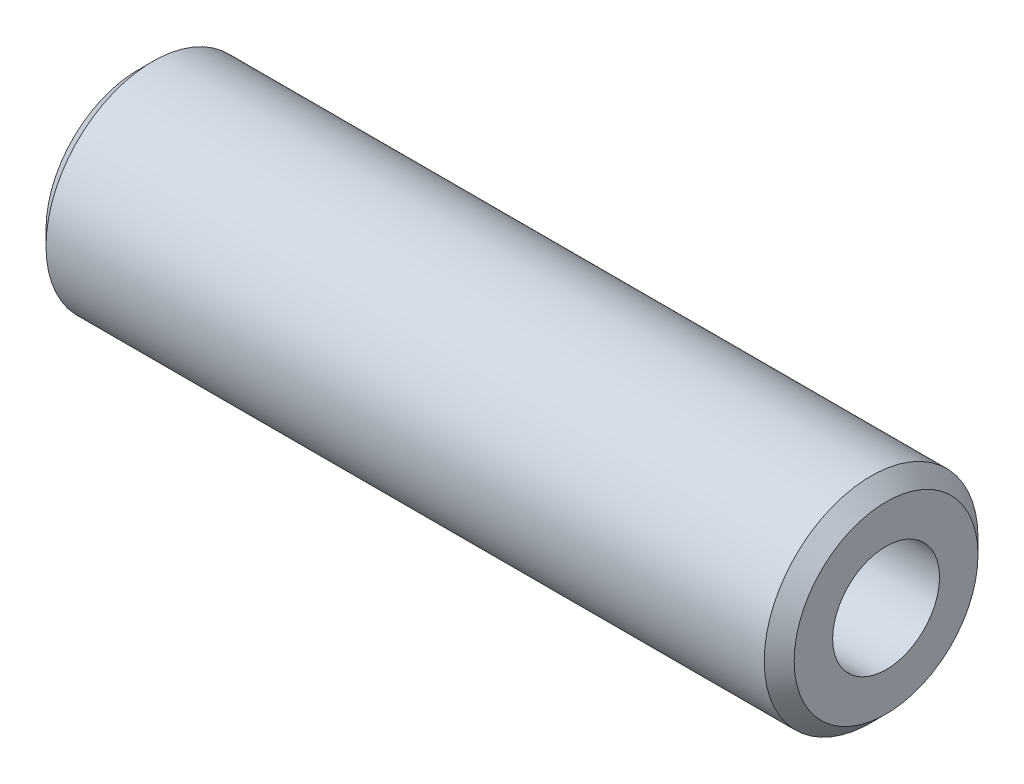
ISO-10303-21;
HEADER;
FILE_DESCRIPTION(('STEP AP214'),'2;1');
FILE_NAME('part.step','',(''),(''),'','','');
FILE_SCHEMA(('AUTOMOTIVE_DESIGN { 1 0 10303 214 1 1 1 1 }'));
ENDSEC;
DATA;
#1=APPLICATION_CONTEXT('core data for automotive mechanical design processes');
#2=APPLICATION_PROTOCOL_DEFINITION('international standard','automotive_design',2000,#1);
#3=PRODUCT_CONTEXT('',#1,'mechanical');
#4=PRODUCT('Part','Part','',(#3));
#5=PRODUCT_RELATED_PRODUCT_CATEGORY('part','',(#4));
#6=PRODUCT_DEFINITION_FORMATION('','',#4);
#7=PRODUCT_DEFINITION_CONTEXT('part definition',#1,'design');
#8=PRODUCT_DEFINITION('design','',#6,#7);
#9=PRODUCT_DEFINITION_SHAPE('','',#8);
#10=(LENGTH_UNIT() NAMED_UNIT(*) SI_UNIT(.MILLI.,.METRE.));
#11=(NAMED_UNIT(*) PLANE_ANGLE_UNIT() SI_UNIT($,.RADIAN.));
#12=(NAMED_UNIT(*) SI_UNIT($,.STERADIAN.) SOLID_ANGLE_UNIT());
#13=UNCERTAINTY_MEASURE_WITH_UNIT(LENGTH_MEASURE(1.E-05),#10,'distance_accuracy_value','');
#14=(GEOMETRIC_REPRESENTATION_CONTEXT(3) GLOBAL_UNCERTAINTY_ASSIGNED_CONTEXT((#13)) GLOBAL_UNIT_ASSIGNED_CONTEXT((#10,
#11,#12)) REPRESENTATION_CONTEXT('',''));
#15=CARTESIAN_POINT('',(0.,0.,0.));
#16=DIRECTION('',(0.,0.,1.));
#17=DIRECTION('',(1.,0.,0.));
#18=AXIS2_PLACEMENT_3D('',#15,#16,#17);
#19=CARTESIAN_POINT('',(0.,6.34999999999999,0.));
#20=DIRECTION('',(1.,0.,0.));
#21=DIRECTION('',(0.,0.,-1.));
#22=AXIS2_PLACEMENT_3D('',#19,#20,#21);
#23=PLANE('',#22);
#24=CARTESIAN_POINT('',(0.,0.,0.));
#25=DIRECTION('',(1.,0.,0.));
#26=DIRECTION('',(0.,0.,-1.));
#27=AXIS2_PLACEMENT_3D('',#24,#25,#26);
#28=CIRCLE('',#27,5.46100000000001);
#29=CARTESIAN_POINT('',(0.,0.,-5.46100000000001));
#30=VERTEX_POINT('',#29);
#31=EDGE_CURVE('E10',#30,#30,#28,.F.);
#32=ORIENTED_EDGE('',*,*,#31,.T.);
#33=EDGE_LOOP('',(#32));
#34=FACE_BOUND('',#33,.T.);
#35=CARTESIAN_POINT('',(0.,0.,0.));
#36=DIRECTION('',(-1.,0.,0.));
#37=DIRECTION('',(0.,0.,1.));
#38=AXIS2_PLACEMENT_3D('',#35,#36,#37);
#39=CIRCLE('',#38,3.175);
#40=CARTESIAN_POINT('',(0.,0.,3.175));
#41=VERTEX_POINT('',#40);
#42=EDGE_CURVE('E51',#41,#41,#39,.T.);
#43=ORIENTED_EDGE('',*,*,#42,.F.);
#44=EDGE_LOOP('',(#43));
#45=FACE_BOUND('',#44,.T.);
#46=ADVANCED_FACE('F31',(#34,#45),#23,.F.);
#47=CARTESIAN_POINT('',(0.,0.,0.));
#48=DIRECTION('',(-1.,0.,0.));
#49=DIRECTION('',(0.,0.,1.));
#50=AXIS2_PLACEMENT_3D('',#47,#48,#49);
#51=CYLINDRICAL_SURFACE('',#50,3.175);
#52=CARTESIAN_POINT('',(44.45,0.,0.));
#53=DIRECTION('',(-1.,0.,0.));
#54=DIRECTION('',(0.,0.,1.));
#55=AXIS2_PLACEMENT_3D('',#52,#53,#54);
#56=CIRCLE('',#55,3.175);
#57=CARTESIAN_POINT('',(44.45,0.,3.175));
#58=VERTEX_POINT('',#57);
#59=EDGE_CURVE('E54',#58,#58,#56,.T.);
#60=ORIENTED_EDGE('',*,*,#59,.F.);
#61=EDGE_LOOP('',(#60));
#62=FACE_BOUND('',#61,.T.);
#63=ORIENTED_EDGE('',*,*,#42,.T.);
#64=EDGE_LOOP('',(#63));
#65=FACE_BOUND('',#64,.T.);
#66=ADVANCED_FACE('F60',(#62,#65),#51,.F.);
#67=CARTESIAN_POINT('',(44.45,3.175,0.));
#68=DIRECTION('',(-1.,0.,0.));
#69=DIRECTION('',(0.,0.,1.));
#70=AXIS2_PLACEMENT_3D('',#67,#68,#69);
#71=PLANE('',#70);
#72=CARTESIAN_POINT('',(44.45,0.,0.));
#73=DIRECTION('',(-1.,0.,0.));
#74=DIRECTION('',(0.,0.,1.));
#75=AXIS2_PLACEMENT_3D('',#72,#73,#74);
#76=CIRCLE('',#75,5.461);
#77=CARTESIAN_POINT('',(44.45,0.,5.461));
#78=VERTEX_POINT('',#77);
#79=EDGE_CURVE('E38',#78,#78,#76,.F.);
#80=ORIENTED_EDGE('',*,*,#79,.T.);
#81=EDGE_LOOP('',(#80));
#82=FACE_BOUND('',#81,.T.);
#83=ORIENTED_EDGE('',*,*,#59,.T.);
#84=EDGE_LOOP('',(#83));
#85=FACE_BOUND('',#84,.T.);
#86=ADVANCED_FACE('F58',(#82,#85),#71,.F.);
#87=CARTESIAN_POINT('',(0.,0.,0.));
#88=DIRECTION('',(-1.,0.,0.));
#89=DIRECTION('',(0.,0.,1.));
#90=AXIS2_PLACEMENT_3D('',#87,#88,#89);
#91=CYLINDRICAL_SURFACE('',#90,6.35);
#92=CARTESIAN_POINT('',(43.561,0.,0.));
#93=DIRECTION('',(-1.,0.,0.));
#94=DIRECTION('',(0.,0.,1.));
#95=AXIS2_PLACEMENT_3D('',#92,#93,#94);
#96=CIRCLE('',#95,6.35);
#97=CARTESIAN_POINT('',(43.561,0.,6.34999999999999));
#98=VERTEX_POINT('',#97);
#99=EDGE_CURVE('E42',#98,#98,#96,.T.);
#100=ORIENTED_EDGE('',*,*,#99,.T.);
#101=EDGE_LOOP('',(#100));
#102=FACE_BOUND('',#101,.T.);
#103=CARTESIAN_POINT('',(0.888999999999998,0.,0.));
#104=DIRECTION('',(1.,0.,0.));
#105=DIRECTION('',(0.,0.,-1.));
#106=AXIS2_PLACEMENT_3D('',#103,#104,#105);
#107=CIRCLE('',#106,6.35);
#108=CARTESIAN_POINT('',(0.888999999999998,0.,-6.35));
#109=VERTEX_POINT('',#108);
#110=EDGE_CURVE('E46',#109,#109,#107,.T.);
#111=ORIENTED_EDGE('',*,*,#110,.T.);
#112=EDGE_LOOP('',(#111));
#113=FACE_BOUND('',#112,.T.);
#114=ADVANCED_FACE('F73',(#102,#113),#91,.T.);
#115=CARTESIAN_POINT('',(43.561,0.,0.));
#116=DIRECTION('',(-1.,0.,0.));
#117=DIRECTION('',(0.,0.,1.));
#118=AXIS2_PLACEMENT_3D('',#115,#116,#117);
#119=CONICAL_SURFACE('',#118,6.35,0.785398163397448);
#120=CARTESIAN_POINT('',(44.45,0.,5.461));
#121=CARTESIAN_POINT('',(44.4407395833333,0.,5.47026041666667));
#122=CARTESIAN_POINT('',(44.4314791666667,0.,5.47952083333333));
#123=CARTESIAN_POINT('',(44.4129583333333,0.,5.49804166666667));
#124=CARTESIAN_POINT('',(44.4036979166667,0.,5.50730208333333));
#125=CARTESIAN_POINT('',(44.3851770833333,0.,5.52582291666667));
#126=CARTESIAN_POINT('',(44.3759166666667,0.,5.53508333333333));
#127=CARTESIAN_POINT('',(44.3573958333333,0.,5.55360416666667));
#128=CARTESIAN_POINT('',(44.3481354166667,0.,5.56286458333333));
#129=CARTESIAN_POINT('',(44.3296145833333,0.,5.58138541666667));
#130=CARTESIAN_POINT('',(44.3203541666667,0.,5.59064583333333));
#131=CARTESIAN_POINT('',(44.3018333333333,0.,5.60916666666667));
#132=CARTESIAN_POINT('',(44.2925729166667,0.,5.61842708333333));
#133=CARTESIAN_POINT('',(44.2740520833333,0.,5.63694791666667));
#134=CARTESIAN_POINT('',(44.2647916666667,0.,5.64620833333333));
#135=CARTESIAN_POINT('',(44.2462708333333,0.,5.66472916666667));
#136=CARTESIAN_POINT('',(44.2370104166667,0.,5.67398958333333));
#137=CARTESIAN_POINT('',(44.2184895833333,0.,5.69251041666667));
#138=CARTESIAN_POINT('',(44.2092291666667,0.,5.70177083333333));
#139=CARTESIAN_POINT('',(44.1907083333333,0.,5.72029166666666));
#140=CARTESIAN_POINT('',(44.1814479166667,0.,5.72955208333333));
#141=CARTESIAN_POINT('',(44.1629270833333,0.,5.74807291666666));
#142=CARTESIAN_POINT('',(44.1536666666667,0.,5.75733333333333));
#143=CARTESIAN_POINT('',(44.1351458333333,0.,5.77585416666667));
#144=CARTESIAN_POINT('',(44.1258854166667,0.,5.78511458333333));
#145=CARTESIAN_POINT('',(44.1073645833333,0.,5.80363541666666));
#146=CARTESIAN_POINT('',(44.0981041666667,0.,5.81289583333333));
#147=CARTESIAN_POINT('',(44.0795833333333,0.,5.83141666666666));
#148=CARTESIAN_POINT('',(44.0703229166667,0.,5.84067708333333));
#149=CARTESIAN_POINT('',(44.0518020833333,0.,5.85919791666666));
#150=CARTESIAN_POINT('',(44.0425416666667,0.,5.86845833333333));
#151=CARTESIAN_POINT('',(44.0240208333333,0.,5.88697916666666));
#152=CARTESIAN_POINT('',(44.0147604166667,0.,5.89623958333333));
#153=CARTESIAN_POINT('',(43.9962395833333,0.,5.91476041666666));
#154=CARTESIAN_POINT('',(43.9869791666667,0.,5.92402083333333));
#155=CARTESIAN_POINT('',(43.9684583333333,0.,5.94254166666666));
#156=CARTESIAN_POINT('',(43.9591979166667,0.,5.95180208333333));
#157=CARTESIAN_POINT('',(43.9406770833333,0.,5.97032291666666));
#158=CARTESIAN_POINT('',(43.9314166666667,0.,5.97958333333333));
#159=CARTESIAN_POINT('',(43.9128958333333,0.,5.99810416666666));
#160=CARTESIAN_POINT('',(43.9036354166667,0.,6.00736458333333));
#161=CARTESIAN_POINT('',(43.8851145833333,0.,6.02588541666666));
#162=CARTESIAN_POINT('',(43.8758541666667,0.,6.03514583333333));
#163=CARTESIAN_POINT('',(43.8573333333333,0.,6.05366666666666));
#164=CARTESIAN_POINT('',(43.8480729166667,0.,6.06292708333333));
#165=CARTESIAN_POINT('',(43.8295520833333,0.,6.08144791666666));
#166=CARTESIAN_POINT('',(43.8202916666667,0.,6.09070833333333));
#167=CARTESIAN_POINT('',(43.8017708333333,0.,6.10922916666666));
#168=CARTESIAN_POINT('',(43.7925104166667,0.,6.11848958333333));
#169=CARTESIAN_POINT('',(43.7739895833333,0.,6.13701041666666));
#170=CARTESIAN_POINT('',(43.7647291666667,0.,6.14627083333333));
#171=CARTESIAN_POINT('',(43.7462083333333,0.,6.16479166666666));
#172=CARTESIAN_POINT('',(43.7369479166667,0.,6.17405208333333));
#173=CARTESIAN_POINT('',(43.7184270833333,0.,6.19257291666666));
#174=CARTESIAN_POINT('',(43.7091666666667,0.,6.20183333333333));
#175=CARTESIAN_POINT('',(43.6906458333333,0.,6.22035416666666));
#176=CARTESIAN_POINT('',(43.6813854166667,0.,6.22961458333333));
#177=CARTESIAN_POINT('',(43.6628645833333,0.,6.24813541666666));
#178=CARTESIAN_POINT('',(43.6536041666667,0.,6.25739583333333));
#179=CARTESIAN_POINT('',(43.6350833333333,0.,6.27591666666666));
#180=CARTESIAN_POINT('',(43.6258229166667,0.,6.28517708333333));
#181=CARTESIAN_POINT('',(43.6073020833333,0.,6.30369791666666));
#182=CARTESIAN_POINT('',(43.5980416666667,0.,6.31295833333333));
#183=CARTESIAN_POINT('',(43.5795208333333,0.,6.33147916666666));
#184=CARTESIAN_POINT('',(43.5702604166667,0.,6.34073958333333));
#185=CARTESIAN_POINT('',(43.561,0.,6.34999999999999));
#186=B_SPLINE_CURVE_WITH_KNOTS('',3,(#120,#121,#122,#123,#124,#125,#126,#127,#128,#129,#130,
#131,#132,#133,#134,#135,#136,#137,#138,#139,#140,#141,#142,#143,#144,#145,#146,#147,#148,#149,
#150,#151,#152,#153,#154,#155,#156,#157,#158,#159,#160,#161,#162,#163,#164,#165,#166,#167,#168,
#169,#170,#171,#172,#173,#174,#175,#176,#177,#178,#179,#180,#181,#182,#183,#184,#185),
.UNSPECIFIED.,.F.,.F.,(4,2,2,2,2,2,2,2,2,2,2,2,2,2,2,2,2,2,2,2,2,2,2,2,2,2,2,2,2,2,2,2,4),(0.,
0.0392886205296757,0.0785772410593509,0.117865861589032,0.157154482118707,0.196443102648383,
0.235731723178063,0.275020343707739,0.314308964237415,0.353597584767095,0.39288620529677,
0.432174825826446,0.471463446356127,0.510752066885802,0.550040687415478,0.589329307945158,
0.628617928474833,0.667906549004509,0.70719516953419,0.746483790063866,0.785772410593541,
0.825061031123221,0.864349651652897,0.903638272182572,0.942926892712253,0.982215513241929,
1.0215041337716,1.06079275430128,1.10008137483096,1.13936999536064,1.17865861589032,
1.21794723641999,1.25723585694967),.UNSPECIFIED.);
#187=EDGE_CURVE('BSEAM71',#78,#98,#186,.T.);
#188=ORIENTED_EDGE('',*,*,#79,.F.);
#189=ORIENTED_EDGE('',*,*,#99,.F.);
#190=ORIENTED_EDGE('',*,*,#187,.T.);
#191=ORIENTED_EDGE('',*,*,#187,.F.);
#192=EDGE_LOOP('',(#188,#190,#189,#191));
#193=FACE_BOUND('',#192,.T.);
#194=ADVANCED_FACE('F71',(#193),#119,.T.);
#195=CARTESIAN_POINT('',(0.,0.,0.));
#196=DIRECTION('',(1.,0.,0.));
#197=DIRECTION('',(0.,0.,-1.));
#198=AXIS2_PLACEMENT_3D('',#195,#196,#197);
#199=CONICAL_SURFACE('',#198,5.46100000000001,0.785398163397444);
#200=ORIENTED_EDGE('',*,*,#110,.F.);
#201=EDGE_LOOP('',(#200));
#202=FACE_BOUND('',#201,.T.);
#203=ORIENTED_EDGE('',*,*,#31,.F.);
#204=EDGE_LOOP('',(#203));
#205=FACE_BOUND('',#204,.T.);
#206=ADVANCED_FACE('F33',(#202,#205),#199,.T.);
#207=CLOSED_SHELL('',(#46,#66,#86,#114,#194,#206));
#208=MANIFOLD_SOLID_BREP('B2',#207);
#209=ADVANCED_BREP_SHAPE_REPRESENTATION('',(#18,#208),#14);
#210=SHAPE_DEFINITION_REPRESENTATION(#9,#209);
ENDSEC;
END-ISO-10303-21;
